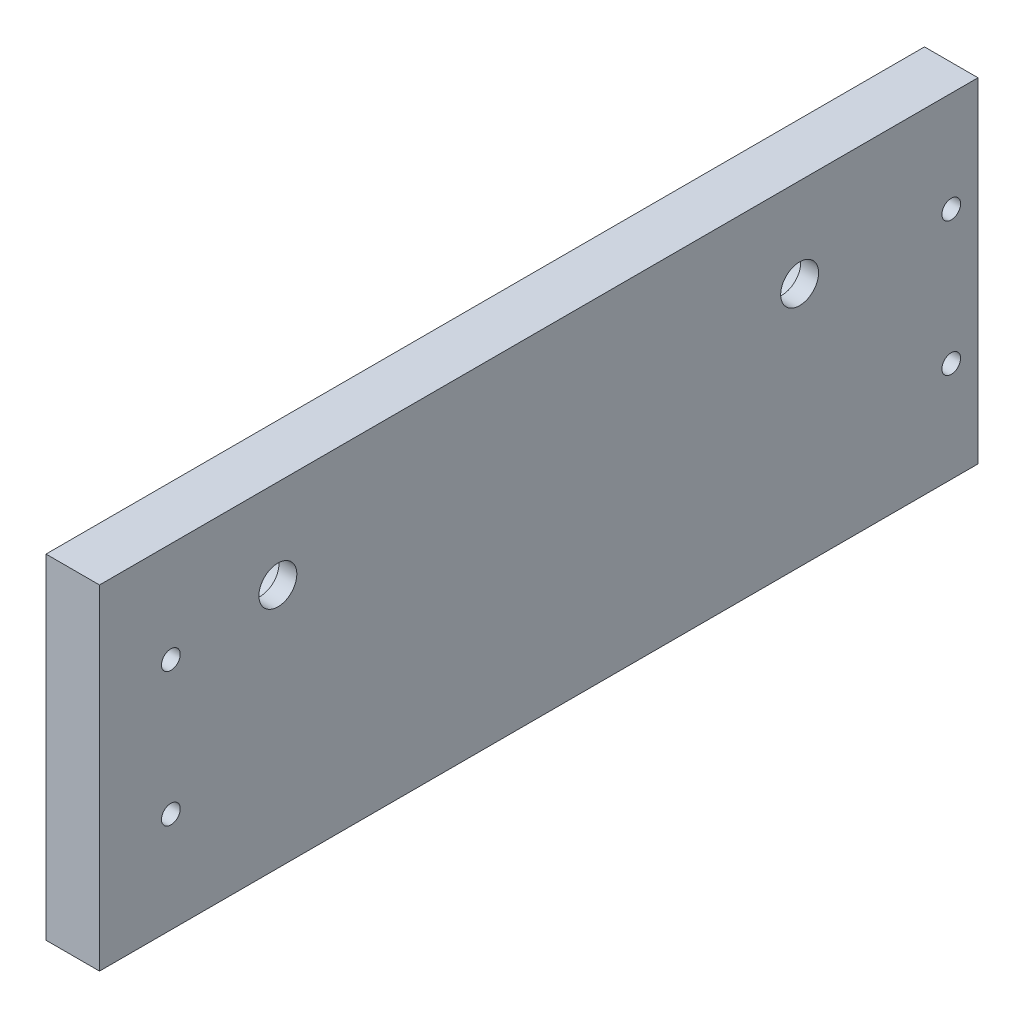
ISO-10303-21;
HEADER;
FILE_DESCRIPTION(('STEP AP214'),'2;1');
FILE_NAME('part.step','',(''),(''),'','','');
FILE_SCHEMA(('AUTOMOTIVE_DESIGN { 1 0 10303 214 1 1 1 1 }'));
ENDSEC;
DATA;
#1=APPLICATION_CONTEXT('core data for automotive mechanical design processes');
#2=APPLICATION_PROTOCOL_DEFINITION('international standard','automotive_design',2000,#1);
#3=PRODUCT_CONTEXT('',#1,'mechanical');
#4=PRODUCT('Part','Part','',(#3));
#5=PRODUCT_RELATED_PRODUCT_CATEGORY('part','',(#4));
#6=PRODUCT_DEFINITION_FORMATION('','',#4);
#7=PRODUCT_DEFINITION_CONTEXT('part definition',#1,'design');
#8=PRODUCT_DEFINITION('design','',#6,#7);
#9=PRODUCT_DEFINITION_SHAPE('','',#8);
#10=(LENGTH_UNIT() NAMED_UNIT(*) SI_UNIT(.MILLI.,.METRE.));
#11=(NAMED_UNIT(*) PLANE_ANGLE_UNIT() SI_UNIT($,.RADIAN.));
#12=(NAMED_UNIT(*) SI_UNIT($,.STERADIAN.) SOLID_ANGLE_UNIT());
#13=UNCERTAINTY_MEASURE_WITH_UNIT(LENGTH_MEASURE(1.E-05),#10,'distance_accuracy_value','');
#14=(GEOMETRIC_REPRESENTATION_CONTEXT(3) GLOBAL_UNCERTAINTY_ASSIGNED_CONTEXT((#13)) GLOBAL_UNIT_ASSIGNED_CONTEXT((#10,
#11,#12)) REPRESENTATION_CONTEXT('',''));
#15=CARTESIAN_POINT('',(0.,0.,0.));
#16=DIRECTION('',(0.,0.,1.));
#17=DIRECTION('',(1.,0.,0.));
#18=AXIS2_PLACEMENT_3D('',#15,#16,#17);
#19=CARTESIAN_POINT('',(8.,17.5,58.5));
#20=DIRECTION('',(-1.,0.,0.));
#21=DIRECTION('',(0.,0.,1.));
#22=AXIS2_PLACEMENT_3D('',#19,#20,#21);
#23=CYLINDRICAL_SURFACE('',#22,6.99999999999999);
#24=CARTESIAN_POINT('',(8.,17.5,58.5));
#25=DIRECTION('',(-1.,0.,0.));
#26=DIRECTION('',(0.,0.,1.));
#27=AXIS2_PLACEMENT_3D('',#24,#25,#26);
#28=CIRCLE('',#27,6.99999999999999);
#29=CARTESIAN_POINT('',(8.,17.5,65.5));
#30=VERTEX_POINT('',#29);
#31=EDGE_CURVE('E126',#30,#30,#28,.T.);
#32=ORIENTED_EDGE('',*,*,#31,.F.);
#33=EDGE_LOOP('',(#32));
#34=FACE_BOUND('',#33,.T.);
#35=CARTESIAN_POINT('',(0.,17.5,58.5));
#36=DIRECTION('',(-1.,0.,0.));
#37=DIRECTION('',(0.,0.,1.));
#38=AXIS2_PLACEMENT_3D('',#35,#36,#37);
#39=CIRCLE('',#38,6.99999999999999);
#40=CARTESIAN_POINT('',(0.,17.5,65.5));
#41=VERTEX_POINT('',#40);
#42=EDGE_CURVE('E124',#41,#41,#39,.T.);
#43=ORIENTED_EDGE('',*,*,#42,.T.);
#44=EDGE_LOOP('',(#43));
#45=FACE_BOUND('',#44,.T.);
#46=ADVANCED_FACE('F17',(#34,#45),#23,.F.);
#47=CARTESIAN_POINT('',(8.,17.5,-58.5));
#48=DIRECTION('',(-1.,0.,0.));
#49=DIRECTION('',(0.,0.,1.));
#50=AXIS2_PLACEMENT_3D('',#47,#48,#49);
#51=CYLINDRICAL_SURFACE('',#50,7.);
#52=CARTESIAN_POINT('',(8.,17.5,-58.5));
#53=DIRECTION('',(-1.,0.,0.));
#54=DIRECTION('',(0.,0.,1.));
#55=AXIS2_PLACEMENT_3D('',#52,#53,#54);
#56=CIRCLE('',#55,7.);
#57=CARTESIAN_POINT('',(8.,17.5,-51.5));
#58=VERTEX_POINT('',#57);
#59=EDGE_CURVE('E20',#58,#58,#56,.T.);
#60=ORIENTED_EDGE('',*,*,#59,.F.);
#61=EDGE_LOOP('',(#60));
#62=FACE_BOUND('',#61,.T.);
#63=CARTESIAN_POINT('',(0.,17.5,-58.5));
#64=DIRECTION('',(-1.,0.,0.));
#65=DIRECTION('',(0.,0.,1.));
#66=AXIS2_PLACEMENT_3D('',#63,#64,#65);
#67=CIRCLE('',#66,7.);
#68=CARTESIAN_POINT('',(0.,17.5,-51.5));
#69=VERTEX_POINT('',#68);
#70=EDGE_CURVE('E121',#69,#69,#67,.T.);
#71=ORIENTED_EDGE('',*,*,#70,.T.);
#72=EDGE_LOOP('',(#71));
#73=FACE_BOUND('',#72,.T.);
#74=ADVANCED_FACE('F135',(#62,#73),#51,.F.);
#75=CARTESIAN_POINT('',(8.,17.5,-58.5));
#76=DIRECTION('',(-1.,0.,0.));
#77=DIRECTION('',(0.,0.,1.));
#78=AXIS2_PLACEMENT_3D('',#75,#76,#77);
#79=PLANE('',#78);
#80=CARTESIAN_POINT('',(8.,17.5,-58.5));
#81=DIRECTION('',(1.,0.,0.));
#82=DIRECTION('',(0.,0.,-1.));
#83=AXIS2_PLACEMENT_3D('',#80,#81,#82);
#84=CIRCLE('',#83,4.25000000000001);
#85=CARTESIAN_POINT('',(8.,17.5,-62.75));
#86=VERTEX_POINT('',#85);
#87=EDGE_CURVE('E118',#86,#86,#84,.T.);
#88=ORIENTED_EDGE('',*,*,#87,.T.);
#89=EDGE_LOOP('',(#88));
#90=FACE_BOUND('',#89,.T.);
#91=ORIENTED_EDGE('',*,*,#59,.T.);
#92=EDGE_LOOP('',(#91));
#93=FACE_BOUND('',#92,.T.);
#94=ADVANCED_FACE('F133',(#90,#93),#79,.T.);
#95=CARTESIAN_POINT('',(8.,17.5,58.5));
#96=DIRECTION('',(-1.,0.,0.));
#97=DIRECTION('',(0.,0.,1.));
#98=AXIS2_PLACEMENT_3D('',#95,#96,#97);
#99=PLANE('',#98);
#100=CARTESIAN_POINT('',(8.,17.5,58.5));
#101=DIRECTION('',(1.,0.,0.));
#102=DIRECTION('',(0.,0.,-1.));
#103=AXIS2_PLACEMENT_3D('',#100,#101,#102);
#104=CIRCLE('',#103,4.25);
#105=CARTESIAN_POINT('',(8.,17.5,54.25));
#106=VERTEX_POINT('',#105);
#107=EDGE_CURVE('E115',#106,#106,#104,.T.);
#108=ORIENTED_EDGE('',*,*,#107,.T.);
#109=EDGE_LOOP('',(#108));
#110=FACE_BOUND('',#109,.T.);
#111=ORIENTED_EDGE('',*,*,#31,.T.);
#112=EDGE_LOOP('',(#111));
#113=FACE_BOUND('',#112,.T.);
#114=ADVANCED_FACE('F143',(#110,#113),#99,.T.);
#115=CARTESIAN_POINT('',(0.,0.,0.));
#116=DIRECTION('',(1.,0.,0.));
#117=DIRECTION('',(0.,0.,-1.));
#118=AXIS2_PLACEMENT_3D('',#115,#116,#117);
#119=PLANE('',#118);
#120=DIRECTION('',(0.,0.,1.));
#121=VECTOR('',#120,1.);
#122=CARTESIAN_POINT('',(0.,-37.5,98.5));
#123=LINE('',#122,#121);
#124=CARTESIAN_POINT('',(0.,-37.5,-98.5));
#125=VERTEX_POINT('',#124);
#126=CARTESIAN_POINT('',(0.,-37.5,98.5));
#127=VERTEX_POINT('',#126);
#128=EDGE_CURVE('E103',#125,#127,#123,.T.);
#129=ORIENTED_EDGE('',*,*,#128,.T.);
#130=DIRECTION('',(0.,1.,0.));
#131=VECTOR('',#130,1.);
#132=CARTESIAN_POINT('',(0.,37.5,98.5));
#133=LINE('',#132,#131);
#134=CARTESIAN_POINT('',(0.,37.5,98.5));
#135=VERTEX_POINT('',#134);
#136=EDGE_CURVE('E73',#127,#135,#133,.T.);
#137=ORIENTED_EDGE('',*,*,#136,.T.);
#138=DIRECTION('',(0.,0.,-1.));
#139=VECTOR('',#138,1.);
#140=CARTESIAN_POINT('',(0.,37.5,98.5));
#141=LINE('',#140,#139);
#142=CARTESIAN_POINT('',(0.,37.5,-98.5));
#143=VERTEX_POINT('',#142);
#144=EDGE_CURVE('E55',#135,#143,#141,.T.);
#145=ORIENTED_EDGE('',*,*,#144,.T.);
#146=DIRECTION('',(0.,-1.,0.));
#147=VECTOR('',#146,1.);
#148=CARTESIAN_POINT('',(0.,37.5,-98.5));
#149=LINE('',#148,#147);
#150=EDGE_CURVE('E60',#143,#125,#149,.T.);
#151=ORIENTED_EDGE('',*,*,#150,.T.);
#152=EDGE_LOOP('',(#129,#137,#145,#151));
#153=FACE_BOUND('',#152,.T.);
#154=CARTESIAN_POINT('',(0.,-15.,-92.5));
#155=DIRECTION('',(1.,0.,0.));
#156=DIRECTION('',(0.,0.,-1.));
#157=AXIS2_PLACEMENT_3D('',#154,#155,#156);
#158=CIRCLE('',#157,2.09999999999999);
#159=CARTESIAN_POINT('',(0.,-15.,-94.6));
#160=VERTEX_POINT('',#159);
#161=EDGE_CURVE('E69',#160,#160,#158,.T.);
#162=ORIENTED_EDGE('',*,*,#161,.T.);
#163=EDGE_LOOP('',(#162));
#164=FACE_BOUND('',#163,.T.);
#165=CARTESIAN_POINT('',(0.,15.,-92.5));
#166=DIRECTION('',(1.,0.,0.));
#167=DIRECTION('',(0.,0.,-1.));
#168=AXIS2_PLACEMENT_3D('',#165,#166,#167);
#169=CIRCLE('',#168,2.09999999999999);
#170=CARTESIAN_POINT('',(0.,15.,-94.6));
#171=VERTEX_POINT('',#170);
#172=EDGE_CURVE('E106',#171,#171,#169,.T.);
#173=ORIENTED_EDGE('',*,*,#172,.T.);
#174=EDGE_LOOP('',(#173));
#175=FACE_BOUND('',#174,.T.);
#176=CARTESIAN_POINT('',(0.,-15.,82.5));
#177=DIRECTION('',(1.,0.,0.));
#178=DIRECTION('',(0.,0.,-1.));
#179=AXIS2_PLACEMENT_3D('',#176,#177,#178);
#180=CIRCLE('',#179,2.09999999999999);
#181=CARTESIAN_POINT('',(0.,-15.,80.4));
#182=VERTEX_POINT('',#181);
#183=EDGE_CURVE('E109',#182,#182,#180,.T.);
#184=ORIENTED_EDGE('',*,*,#183,.T.);
#185=EDGE_LOOP('',(#184));
#186=FACE_BOUND('',#185,.T.);
#187=CARTESIAN_POINT('',(0.,15.,82.5));
#188=DIRECTION('',(1.,0.,0.));
#189=DIRECTION('',(0.,0.,-1.));
#190=AXIS2_PLACEMENT_3D('',#187,#188,#189);
#191=CIRCLE('',#190,2.09999999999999);
#192=CARTESIAN_POINT('',(0.,15.,80.4));
#193=VERTEX_POINT('',#192);
#194=EDGE_CURVE('E112',#193,#193,#191,.T.);
#195=ORIENTED_EDGE('',*,*,#194,.T.);
#196=EDGE_LOOP('',(#195));
#197=FACE_BOUND('',#196,.T.);
#198=ORIENTED_EDGE('',*,*,#70,.F.);
#199=EDGE_LOOP('',(#198));
#200=FACE_BOUND('',#199,.T.);
#201=ORIENTED_EDGE('',*,*,#42,.F.);
#202=EDGE_LOOP('',(#201));
#203=FACE_BOUND('',#202,.T.);
#204=ADVANCED_FACE('F71',(#153,#164,#175,#186,#197,#200,#203),#119,.F.);
#205=CARTESIAN_POINT('',(0.,17.5,-58.5));
#206=DIRECTION('',(1.,0.,0.));
#207=DIRECTION('',(0.,0.,-1.));
#208=AXIS2_PLACEMENT_3D('',#205,#206,#207);
#209=CYLINDRICAL_SURFACE('',#208,4.25000000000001);
#210=CARTESIAN_POINT('',(12.,17.5,-58.5));
#211=DIRECTION('',(1.,0.,0.));
#212=DIRECTION('',(0.,0.,-1.));
#213=AXIS2_PLACEMENT_3D('',#210,#211,#212);
#214=CIRCLE('',#213,4.25000000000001);
#215=CARTESIAN_POINT('',(12.,17.5,-62.75));
#216=VERTEX_POINT('',#215);
#217=EDGE_CURVE('E100',#216,#216,#214,.F.);
#218=ORIENTED_EDGE('',*,*,#217,.F.);
#219=EDGE_LOOP('',(#218));
#220=FACE_BOUND('',#219,.T.);
#221=ORIENTED_EDGE('',*,*,#87,.F.);
#222=EDGE_LOOP('',(#221));
#223=FACE_BOUND('',#222,.T.);
#224=ADVANCED_FACE('F142',(#220,#223),#209,.F.);
#225=CARTESIAN_POINT('',(0.,17.5,58.5));
#226=DIRECTION('',(1.,0.,0.));
#227=DIRECTION('',(0.,0.,-1.));
#228=AXIS2_PLACEMENT_3D('',#225,#226,#227);
#229=CYLINDRICAL_SURFACE('',#228,4.25);
#230=CARTESIAN_POINT('',(12.,17.5,58.5));
#231=DIRECTION('',(1.,0.,0.));
#232=DIRECTION('',(0.,0.,-1.));
#233=AXIS2_PLACEMENT_3D('',#230,#231,#232);
#234=CIRCLE('',#233,4.25);
#235=CARTESIAN_POINT('',(12.,17.5,54.25));
#236=VERTEX_POINT('',#235);
#237=EDGE_CURVE('E97',#236,#236,#234,.F.);
#238=ORIENTED_EDGE('',*,*,#237,.F.);
#239=EDGE_LOOP('',(#238));
#240=FACE_BOUND('',#239,.T.);
#241=ORIENTED_EDGE('',*,*,#107,.F.);
#242=EDGE_LOOP('',(#241));
#243=FACE_BOUND('',#242,.T.);
#244=ADVANCED_FACE('F187',(#240,#243),#229,.F.);
#245=CARTESIAN_POINT('',(12.,15.,82.5));
#246=DIRECTION('',(1.,0.,0.));
#247=DIRECTION('',(0.,0.,-1.));
#248=AXIS2_PLACEMENT_3D('',#245,#246,#247);
#249=CYLINDRICAL_SURFACE('',#248,2.09999999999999);
#250=CARTESIAN_POINT('',(12.,15.,82.5));
#251=DIRECTION('',(1.,0.,0.));
#252=DIRECTION('',(0.,0.,-1.));
#253=AXIS2_PLACEMENT_3D('',#250,#251,#252);
#254=CIRCLE('',#253,2.09999999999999);
#255=CARTESIAN_POINT('',(12.,15.,80.4));
#256=VERTEX_POINT('',#255);
#257=EDGE_CURVE('E94',#256,#256,#254,.F.);
#258=ORIENTED_EDGE('',*,*,#257,.F.);
#259=EDGE_LOOP('',(#258));
#260=FACE_BOUND('',#259,.T.);
#261=ORIENTED_EDGE('',*,*,#194,.F.);
#262=EDGE_LOOP('',(#261));
#263=FACE_BOUND('',#262,.T.);
#264=ADVANCED_FACE('F183',(#260,#263),#249,.F.);
#265=CARTESIAN_POINT('',(12.,-15.,82.5));
#266=DIRECTION('',(1.,0.,0.));
#267=DIRECTION('',(0.,0.,-1.));
#268=AXIS2_PLACEMENT_3D('',#265,#266,#267);
#269=CYLINDRICAL_SURFACE('',#268,2.09999999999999);
#270=CARTESIAN_POINT('',(12.,-15.,82.5));
#271=DIRECTION('',(1.,0.,0.));
#272=DIRECTION('',(0.,0.,-1.));
#273=AXIS2_PLACEMENT_3D('',#270,#271,#272);
#274=CIRCLE('',#273,2.09999999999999);
#275=CARTESIAN_POINT('',(12.,-15.,80.4));
#276=VERTEX_POINT('',#275);
#277=EDGE_CURVE('E91',#276,#276,#274,.F.);
#278=ORIENTED_EDGE('',*,*,#277,.F.);
#279=EDGE_LOOP('',(#278));
#280=FACE_BOUND('',#279,.T.);
#281=ORIENTED_EDGE('',*,*,#183,.F.);
#282=EDGE_LOOP('',(#281));
#283=FACE_BOUND('',#282,.T.);
#284=ADVANCED_FACE('F179',(#280,#283),#269,.F.);
#285=CARTESIAN_POINT('',(12.,15.,-92.5));
#286=DIRECTION('',(1.,0.,0.));
#287=DIRECTION('',(0.,0.,-1.));
#288=AXIS2_PLACEMENT_3D('',#285,#286,#287);
#289=CYLINDRICAL_SURFACE('',#288,2.09999999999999);
#290=CARTESIAN_POINT('',(12.,15.,-92.5));
#291=DIRECTION('',(1.,0.,0.));
#292=DIRECTION('',(0.,0.,-1.));
#293=AXIS2_PLACEMENT_3D('',#290,#291,#292);
#294=CIRCLE('',#293,2.09999999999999);
#295=CARTESIAN_POINT('',(12.,15.,-94.6));
#296=VERTEX_POINT('',#295);
#297=EDGE_CURVE('E88',#296,#296,#294,.F.);
#298=ORIENTED_EDGE('',*,*,#297,.F.);
#299=EDGE_LOOP('',(#298));
#300=FACE_BOUND('',#299,.T.);
#301=ORIENTED_EDGE('',*,*,#172,.F.);
#302=EDGE_LOOP('',(#301));
#303=FACE_BOUND('',#302,.T.);
#304=ADVANCED_FACE('F175',(#300,#303),#289,.F.);
#305=CARTESIAN_POINT('',(12.,-15.,-92.5));
#306=DIRECTION('',(1.,0.,0.));
#307=DIRECTION('',(0.,0.,-1.));
#308=AXIS2_PLACEMENT_3D('',#305,#306,#307);
#309=CYLINDRICAL_SURFACE('',#308,2.09999999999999);
#310=CARTESIAN_POINT('',(12.,-15.,-92.5));
#311=DIRECTION('',(1.,0.,0.));
#312=DIRECTION('',(0.,0.,-1.));
#313=AXIS2_PLACEMENT_3D('',#310,#311,#312);
#314=CIRCLE('',#313,2.09999999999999);
#315=CARTESIAN_POINT('',(12.,-15.,-94.6));
#316=VERTEX_POINT('',#315);
#317=EDGE_CURVE('E84',#316,#316,#314,.F.);
#318=ORIENTED_EDGE('',*,*,#317,.F.);
#319=EDGE_LOOP('',(#318));
#320=FACE_BOUND('',#319,.T.);
#321=ORIENTED_EDGE('',*,*,#161,.F.);
#322=EDGE_LOOP('',(#321));
#323=FACE_BOUND('',#322,.T.);
#324=ADVANCED_FACE('F172',(#320,#323),#309,.F.);
#325=CARTESIAN_POINT('',(12.,37.5,-98.5));
#326=DIRECTION('',(0.,0.,1.));
#327=DIRECTION('',(0.,-1.,0.));
#328=AXIS2_PLACEMENT_3D('',#325,#326,#327);
#329=PLANE('',#328);
#330=DIRECTION('',(1.,0.,0.));
#331=VECTOR('',#330,1.);
#332=CARTESIAN_POINT('',(12.,37.5,-98.5));
#333=LINE('',#332,#331);
#334=CARTESIAN_POINT('',(12.,37.5,-98.5));
#335=VERTEX_POINT('',#334);
#336=EDGE_CURVE('E62',#143,#335,#333,.T.);
#337=ORIENTED_EDGE('',*,*,#336,.T.);
#338=DIRECTION('',(0.,1.,0.));
#339=VECTOR('',#338,1.);
#340=CARTESIAN_POINT('',(12.,0.,-98.5));
#341=LINE('',#340,#339);
#342=CARTESIAN_POINT('',(12.,-37.5,-98.5));
#343=VERTEX_POINT('',#342);
#344=EDGE_CURVE('E87',#343,#335,#341,.T.);
#345=ORIENTED_EDGE('',*,*,#344,.F.);
#346=DIRECTION('',(1.,0.,0.));
#347=VECTOR('',#346,1.);
#348=CARTESIAN_POINT('',(12.,-37.5,-98.5));
#349=LINE('',#348,#347);
#350=EDGE_CURVE('E65',#343,#125,#349,.F.);
#351=ORIENTED_EDGE('',*,*,#350,.T.);
#352=ORIENTED_EDGE('',*,*,#150,.F.);
#353=EDGE_LOOP('',(#337,#345,#351,#352));
#354=FACE_BOUND('',#353,.T.);
#355=ADVANCED_FACE('F61',(#354),#329,.F.);
#356=CARTESIAN_POINT('',(12.,37.5,98.5));
#357=DIRECTION('',(0.,-1.,0.));
#358=DIRECTION('',(0.,0.,-1.));
#359=AXIS2_PLACEMENT_3D('',#356,#357,#358);
#360=PLANE('',#359);
#361=DIRECTION('',(1.,0.,0.));
#362=VECTOR('',#361,1.);
#363=CARTESIAN_POINT('',(12.,37.5,98.5));
#364=LINE('',#363,#362);
#365=CARTESIAN_POINT('',(12.,37.5,98.5));
#366=VERTEX_POINT('',#365);
#367=EDGE_CURVE('E75',#135,#366,#364,.T.);
#368=ORIENTED_EDGE('',*,*,#367,.T.);
#369=DIRECTION('',(0.,0.,-1.));
#370=VECTOR('',#369,1.);
#371=CARTESIAN_POINT('',(12.,37.5,0.));
#372=LINE('',#371,#370);
#373=EDGE_CURVE('E79',#335,#366,#372,.F.);
#374=ORIENTED_EDGE('',*,*,#373,.F.);
#375=ORIENTED_EDGE('',*,*,#336,.F.);
#376=ORIENTED_EDGE('',*,*,#144,.F.);
#377=EDGE_LOOP('',(#368,#374,#375,#376));
#378=FACE_BOUND('',#377,.T.);
#379=ADVANCED_FACE('F77',(#378),#360,.F.);
#380=CARTESIAN_POINT('',(12.,37.5,98.5));
#381=DIRECTION('',(0.,0.,-1.));
#382=DIRECTION('',(0.,1.,0.));
#383=AXIS2_PLACEMENT_3D('',#380,#381,#382);
#384=PLANE('',#383);
#385=DIRECTION('',(1.,0.,0.));
#386=VECTOR('',#385,1.);
#387=CARTESIAN_POINT('',(12.,-37.5,98.5));
#388=LINE('',#387,#386);
#389=CARTESIAN_POINT('',(12.,-37.5,98.5));
#390=VERTEX_POINT('',#389);
#391=EDGE_CURVE('E35',#127,#390,#388,.T.);
#392=ORIENTED_EDGE('',*,*,#391,.T.);
#393=DIRECTION('',(0.,1.,0.));
#394=VECTOR('',#393,1.);
#395=CARTESIAN_POINT('',(12.,0.,98.5));
#396=LINE('',#395,#394);
#397=EDGE_CURVE('E26',#366,#390,#396,.F.);
#398=ORIENTED_EDGE('',*,*,#397,.F.);
#399=ORIENTED_EDGE('',*,*,#367,.F.);
#400=ORIENTED_EDGE('',*,*,#136,.F.);
#401=EDGE_LOOP('',(#392,#398,#399,#400));
#402=FACE_BOUND('',#401,.T.);
#403=ADVANCED_FACE('F160',(#402),#384,.F.);
#404=CARTESIAN_POINT('',(12.,-37.5,98.5));
#405=DIRECTION('',(0.,1.,0.));
#406=DIRECTION('',(0.,0.,1.));
#407=AXIS2_PLACEMENT_3D('',#404,#405,#406);
#408=PLANE('',#407);
#409=ORIENTED_EDGE('',*,*,#350,.F.);
#410=DIRECTION('',(0.,0.,-1.));
#411=VECTOR('',#410,1.);
#412=CARTESIAN_POINT('',(12.,-37.5,0.));
#413=LINE('',#412,#411);
#414=EDGE_CURVE('E11',#390,#343,#413,.T.);
#415=ORIENTED_EDGE('',*,*,#414,.F.);
#416=ORIENTED_EDGE('',*,*,#391,.F.);
#417=ORIENTED_EDGE('',*,*,#128,.F.);
#418=EDGE_LOOP('',(#409,#415,#416,#417));
#419=FACE_BOUND('',#418,.T.);
#420=ADVANCED_FACE('F154',(#419),#408,.F.);
#421=CARTESIAN_POINT('',(12.,0.,0.));
#422=DIRECTION('',(1.,0.,0.));
#423=DIRECTION('',(0.,0.,-1.));
#424=AXIS2_PLACEMENT_3D('',#421,#422,#423);
#425=PLANE('',#424);
#426=ORIENTED_EDGE('',*,*,#397,.T.);
#427=ORIENTED_EDGE('',*,*,#414,.T.);
#428=ORIENTED_EDGE('',*,*,#344,.T.);
#429=ORIENTED_EDGE('',*,*,#373,.T.);
#430=EDGE_LOOP('',(#426,#427,#428,#429));
#431=FACE_BOUND('',#430,.T.);
#432=ORIENTED_EDGE('',*,*,#317,.T.);
#433=EDGE_LOOP('',(#432));
#434=FACE_BOUND('',#433,.T.);
#435=ORIENTED_EDGE('',*,*,#297,.T.);
#436=EDGE_LOOP('',(#435));
#437=FACE_BOUND('',#436,.T.);
#438=ORIENTED_EDGE('',*,*,#277,.T.);
#439=EDGE_LOOP('',(#438));
#440=FACE_BOUND('',#439,.T.);
#441=ORIENTED_EDGE('',*,*,#257,.T.);
#442=EDGE_LOOP('',(#441));
#443=FACE_BOUND('',#442,.T.);
#444=ORIENTED_EDGE('',*,*,#237,.T.);
#445=EDGE_LOOP('',(#444));
#446=FACE_BOUND('',#445,.T.);
#447=ORIENTED_EDGE('',*,*,#217,.T.);
#448=EDGE_LOOP('',(#447));
#449=FACE_BOUND('',#448,.T.);
#450=ADVANCED_FACE('F152',(#431,#434,#437,#440,#443,#446,#449),#425,.T.);
#451=CLOSED_SHELL('',(#46,#74,#94,#114,#204,#224,#244,#264,#284,#304,#324,#355,#379,#403,#420,#450));
#452=MANIFOLD_SOLID_BREP('B1',#451);
#453=ADVANCED_BREP_SHAPE_REPRESENTATION('',(#18,#452),#14);
#454=SHAPE_DEFINITION_REPRESENTATION(#9,#453);
ENDSEC;
END-ISO-10303-21;
